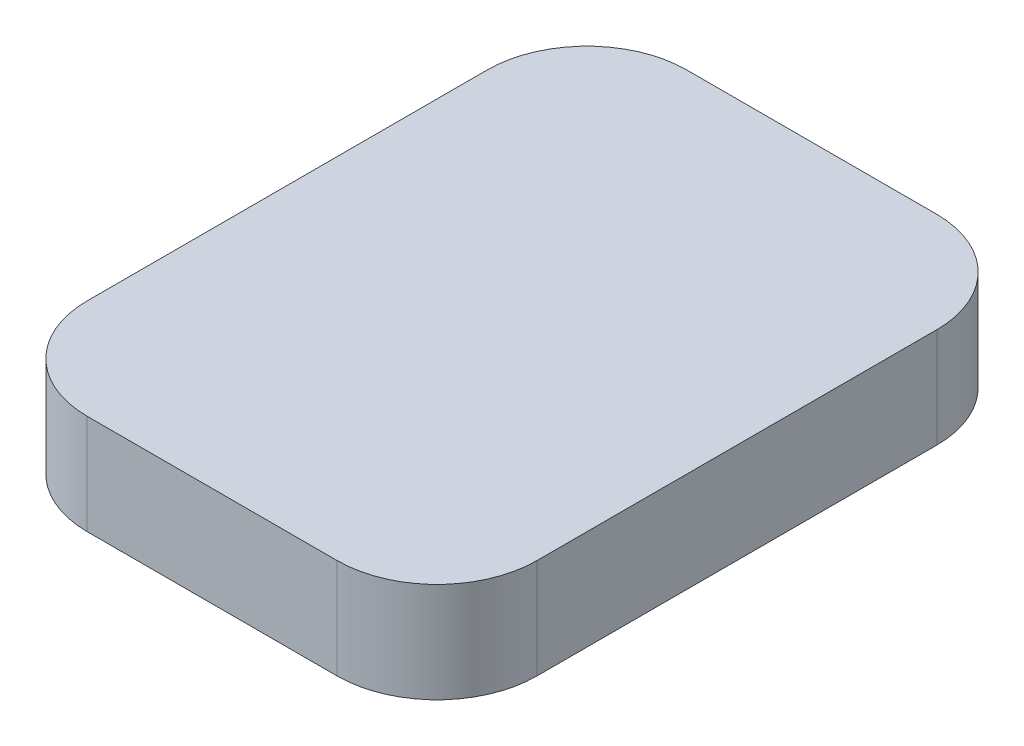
ISO-10303-21;
HEADER;
FILE_DESCRIPTION(('STEP AP214'),'2;1');
FILE_NAME('part.step','',(''),(''),'','','');
FILE_SCHEMA(('AUTOMOTIVE_DESIGN { 1 0 10303 214 1 1 1 1 }'));
ENDSEC;
DATA;
#1=APPLICATION_CONTEXT('core data for automotive mechanical design processes');
#2=APPLICATION_PROTOCOL_DEFINITION('international standard','automotive_design',2000,#1);
#3=PRODUCT_CONTEXT('',#1,'mechanical');
#4=PRODUCT('Part','Part','',(#3));
#5=PRODUCT_RELATED_PRODUCT_CATEGORY('part','',(#4));
#6=PRODUCT_DEFINITION_FORMATION('','',#4);
#7=PRODUCT_DEFINITION_CONTEXT('part definition',#1,'design');
#8=PRODUCT_DEFINITION('design','',#6,#7);
#9=PRODUCT_DEFINITION_SHAPE('','',#8);
#10=(LENGTH_UNIT() NAMED_UNIT(*) SI_UNIT(.MILLI.,.METRE.));
#11=(NAMED_UNIT(*) PLANE_ANGLE_UNIT() SI_UNIT($,.RADIAN.));
#12=(NAMED_UNIT(*) SI_UNIT($,.STERADIAN.) SOLID_ANGLE_UNIT());
#13=UNCERTAINTY_MEASURE_WITH_UNIT(LENGTH_MEASURE(1.E-05),#10,'distance_accuracy_value','');
#14=(GEOMETRIC_REPRESENTATION_CONTEXT(3) GLOBAL_UNCERTAINTY_ASSIGNED_CONTEXT((#13)) GLOBAL_UNIT_ASSIGNED_CONTEXT((#10,
#11,#12)) REPRESENTATION_CONTEXT('',''));
#15=CARTESIAN_POINT('',(0.,0.,0.));
#16=DIRECTION('',(0.,0.,1.));
#17=DIRECTION('',(1.,0.,0.));
#18=AXIS2_PLACEMENT_3D('',#15,#16,#17);
#19=CARTESIAN_POINT('',(-16.5171922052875,2.,-10.080148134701));
#20=DIRECTION('',(0.,-1.,0.));
#21=DIRECTION('',(0.,0.,-1.));
#22=AXIS2_PLACEMENT_3D('',#19,#20,#21);
#23=CYLINDRICAL_SURFACE('',#22,2.);
#24=CARTESIAN_POINT('',(-16.5171922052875,0.,-10.080148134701));
#25=DIRECTION('',(0.,1.,0.));
#26=DIRECTION('',(0.,0.,-1.));
#27=AXIS2_PLACEMENT_3D('',#24,#25,#26);
#28=CIRCLE('',#27,2.);
#29=CARTESIAN_POINT('',(-16.5171922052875,0.,-12.080148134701));
#30=VERTEX_POINT('',#29);
#31=CARTESIAN_POINT('',(-18.5171922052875,0.,-10.080148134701));
#32=VERTEX_POINT('',#31);
#33=EDGE_CURVE('E136',#30,#32,#28,.T.);
#34=ORIENTED_EDGE('',*,*,#33,.T.);
#35=DIRECTION('',(0.,-1.,0.));
#36=VECTOR('',#35,1.);
#37=CARTESIAN_POINT('',(-18.5171922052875,2.,-10.080148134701));
#38=LINE('',#37,#36);
#39=CARTESIAN_POINT('',(-18.5171922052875,2.,-10.080148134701));
#40=VERTEX_POINT('',#39);
#41=EDGE_CURVE('E11',#40,#32,#38,.T.);
#42=ORIENTED_EDGE('',*,*,#41,.F.);
#43=CARTESIAN_POINT('',(-16.5171922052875,2.,-10.080148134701));
#44=DIRECTION('',(0.,1.,0.));
#45=DIRECTION('',(0.,0.,-1.));
#46=AXIS2_PLACEMENT_3D('',#43,#44,#45);
#47=CIRCLE('',#46,2.);
#48=CARTESIAN_POINT('',(-16.5171922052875,2.,-12.080148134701));
#49=VERTEX_POINT('',#48);
#50=EDGE_CURVE('E150',#49,#40,#47,.T.);
#51=ORIENTED_EDGE('',*,*,#50,.F.);
#52=DIRECTION('',(0.,-1.,0.));
#53=VECTOR('',#52,1.);
#54=CARTESIAN_POINT('',(-16.5171922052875,2.,-12.080148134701));
#55=LINE('',#54,#53);
#56=EDGE_CURVE('E132',#49,#30,#55,.T.);
#57=ORIENTED_EDGE('',*,*,#56,.T.);
#58=EDGE_LOOP('',(#34,#42,#51,#57));
#59=FACE_BOUND('',#58,.T.);
#60=ADVANCED_FACE('F40',(#59),#23,.T.);
#61=CARTESIAN_POINT('',(-18.5171922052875,2.,-2.08014813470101));
#62=DIRECTION('',(1.,0.,0.));
#63=DIRECTION('',(0.,0.,-1.));
#64=AXIS2_PLACEMENT_3D('',#61,#62,#63);
#65=PLANE('',#64);
#66=DIRECTION('',(0.,0.,1.));
#67=VECTOR('',#66,1.);
#68=CARTESIAN_POINT('',(-18.5171922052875,0.,-2.08014813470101));
#69=LINE('',#68,#67);
#70=CARTESIAN_POINT('',(-18.5171922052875,0.,-2.08014813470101));
#71=VERTEX_POINT('',#70);
#72=EDGE_CURVE('E139',#32,#71,#69,.T.);
#73=ORIENTED_EDGE('',*,*,#72,.T.);
#74=DIRECTION('',(0.,-1.,0.));
#75=VECTOR('',#74,1.);
#76=CARTESIAN_POINT('',(-18.5171922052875,2.,-2.08014813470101));
#77=LINE('',#76,#75);
#78=CARTESIAN_POINT('',(-18.5171922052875,2.,-2.08014813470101));
#79=VERTEX_POINT('',#78);
#80=EDGE_CURVE('E48',#79,#71,#77,.T.);
#81=ORIENTED_EDGE('',*,*,#80,.F.);
#82=DIRECTION('',(0.,0.,1.));
#83=VECTOR('',#82,1.);
#84=CARTESIAN_POINT('',(-18.5171922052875,2.,-2.08014813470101));
#85=LINE('',#84,#83);
#86=EDGE_CURVE('E99',#40,#79,#85,.T.);
#87=ORIENTED_EDGE('',*,*,#86,.F.);
#88=ORIENTED_EDGE('',*,*,#41,.T.);
#89=EDGE_LOOP('',(#73,#81,#87,#88));
#90=FACE_BOUND('',#89,.T.);
#91=ADVANCED_FACE('F185',(#90),#65,.F.);
#92=CARTESIAN_POINT('',(-16.5171922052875,2.,-2.08014813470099));
#93=DIRECTION('',(0.,-1.,0.));
#94=DIRECTION('',(0.,0.,-1.));
#95=AXIS2_PLACEMENT_3D('',#92,#93,#94);
#96=CYLINDRICAL_SURFACE('',#95,2.);
#97=CARTESIAN_POINT('',(-16.5171922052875,0.,-2.08014813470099));
#98=DIRECTION('',(0.,1.,0.));
#99=DIRECTION('',(0.,0.,1.));
#100=AXIS2_PLACEMENT_3D('',#97,#98,#99);
#101=CIRCLE('',#100,2.);
#102=CARTESIAN_POINT('',(-16.5171922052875,0.,-0.0801481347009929));
#103=VERTEX_POINT('',#102);
#104=EDGE_CURVE('E141',#71,#103,#101,.T.);
#105=ORIENTED_EDGE('',*,*,#104,.T.);
#106=DIRECTION('',(0.,-1.,0.));
#107=VECTOR('',#106,1.);
#108=CARTESIAN_POINT('',(-16.5171922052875,2.,-0.0801481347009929));
#109=LINE('',#108,#107);
#110=CARTESIAN_POINT('',(-16.5171922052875,2.,-0.0801481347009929));
#111=VERTEX_POINT('',#110);
#112=EDGE_CURVE('E157',#111,#103,#109,.T.);
#113=ORIENTED_EDGE('',*,*,#112,.F.);
#114=CARTESIAN_POINT('',(-16.5171922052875,2.,-2.08014813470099));
#115=DIRECTION('',(0.,1.,0.));
#116=DIRECTION('',(0.,0.,1.));
#117=AXIS2_PLACEMENT_3D('',#114,#115,#116);
#118=CIRCLE('',#117,2.);
#119=EDGE_CURVE('E165',#79,#111,#118,.T.);
#120=ORIENTED_EDGE('',*,*,#119,.F.);
#121=ORIENTED_EDGE('',*,*,#80,.T.);
#122=EDGE_LOOP('',(#105,#113,#120,#121));
#123=FACE_BOUND('',#122,.T.);
#124=ADVANCED_FACE('F163',(#123),#96,.T.);
#125=CARTESIAN_POINT('',(-11.5171922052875,2.,-0.0801481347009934));
#126=DIRECTION('',(0.,0.,-1.));
#127=DIRECTION('',(-1.,0.,0.));
#128=AXIS2_PLACEMENT_3D('',#125,#126,#127);
#129=PLANE('',#128);
#130=DIRECTION('',(1.,0.,0.));
#131=VECTOR('',#130,1.);
#132=CARTESIAN_POINT('',(-11.5171922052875,0.,-0.0801481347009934));
#133=LINE('',#132,#131);
#134=CARTESIAN_POINT('',(-11.5171922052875,0.,-0.0801481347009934));
#135=VERTEX_POINT('',#134);
#136=EDGE_CURVE('E143',#103,#135,#133,.T.);
#137=ORIENTED_EDGE('',*,*,#136,.T.);
#138=DIRECTION('',(0.,-1.,0.));
#139=VECTOR('',#138,1.);
#140=CARTESIAN_POINT('',(-11.5171922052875,2.,-0.0801481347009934));
#141=LINE('',#140,#139);
#142=CARTESIAN_POINT('',(-11.5171922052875,2.,-0.0801481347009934));
#143=VERTEX_POINT('',#142);
#144=EDGE_CURVE('E154',#143,#135,#141,.T.);
#145=ORIENTED_EDGE('',*,*,#144,.F.);
#146=DIRECTION('',(1.,0.,0.));
#147=VECTOR('',#146,1.);
#148=CARTESIAN_POINT('',(-11.5171922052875,2.,-0.0801481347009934));
#149=LINE('',#148,#147);
#150=EDGE_CURVE('E177',#111,#143,#149,.T.);
#151=ORIENTED_EDGE('',*,*,#150,.F.);
#152=ORIENTED_EDGE('',*,*,#112,.T.);
#153=EDGE_LOOP('',(#137,#145,#151,#152));
#154=FACE_BOUND('',#153,.T.);
#155=ADVANCED_FACE('F173',(#154),#129,.F.);
#156=CARTESIAN_POINT('',(-11.5171922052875,2.,-2.08014813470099));
#157=DIRECTION('',(0.,-1.,0.));
#158=DIRECTION('',(0.,0.,-1.));
#159=AXIS2_PLACEMENT_3D('',#156,#157,#158);
#160=CYLINDRICAL_SURFACE('',#159,2.);
#161=CARTESIAN_POINT('',(-11.5171922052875,0.,-2.08014813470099));
#162=DIRECTION('',(0.,1.,0.));
#163=DIRECTION('',(0.,0.,1.));
#164=AXIS2_PLACEMENT_3D('',#161,#162,#163);
#165=CIRCLE('',#164,2.);
#166=CARTESIAN_POINT('',(-9.51719220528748,0.,-2.08014813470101));
#167=VERTEX_POINT('',#166);
#168=EDGE_CURVE('E145',#135,#167,#165,.T.);
#169=ORIENTED_EDGE('',*,*,#168,.T.);
#170=DIRECTION('',(0.,-1.,0.));
#171=VECTOR('',#170,1.);
#172=CARTESIAN_POINT('',(-9.51719220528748,2.,-2.08014813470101));
#173=LINE('',#172,#171);
#174=CARTESIAN_POINT('',(-9.51719220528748,2.,-2.08014813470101));
#175=VERTEX_POINT('',#174);
#176=EDGE_CURVE('E127',#175,#167,#173,.T.);
#177=ORIENTED_EDGE('',*,*,#176,.F.);
#178=CARTESIAN_POINT('',(-11.5171922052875,2.,-2.08014813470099));
#179=DIRECTION('',(0.,1.,0.));
#180=DIRECTION('',(0.,0.,1.));
#181=AXIS2_PLACEMENT_3D('',#178,#179,#180);
#182=CIRCLE('',#181,2.);
#183=EDGE_CURVE('E118',#143,#175,#182,.T.);
#184=ORIENTED_EDGE('',*,*,#183,.F.);
#185=ORIENTED_EDGE('',*,*,#144,.T.);
#186=EDGE_LOOP('',(#169,#177,#184,#185));
#187=FACE_BOUND('',#186,.T.);
#188=ADVANCED_FACE('F176',(#187),#160,.T.);
#189=CARTESIAN_POINT('',(-9.51719220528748,2.,-2.08014813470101));
#190=DIRECTION('',(-1.,0.,0.));
#191=DIRECTION('',(0.,0.,1.));
#192=AXIS2_PLACEMENT_3D('',#189,#190,#191);
#193=PLANE('',#192);
#194=DIRECTION('',(0.,0.,-1.));
#195=VECTOR('',#194,1.);
#196=CARTESIAN_POINT('',(-9.51719220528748,0.,-2.08014813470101));
#197=LINE('',#196,#195);
#198=CARTESIAN_POINT('',(-9.51719220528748,0.,-10.080148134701));
#199=VERTEX_POINT('',#198);
#200=EDGE_CURVE('E126',#167,#199,#197,.T.);
#201=ORIENTED_EDGE('',*,*,#200,.T.);
#202=DIRECTION('',(0.,-1.,0.));
#203=VECTOR('',#202,1.);
#204=CARTESIAN_POINT('',(-9.51719220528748,2.,-10.080148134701));
#205=LINE('',#204,#203);
#206=CARTESIAN_POINT('',(-9.51719220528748,2.,-10.080148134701));
#207=VERTEX_POINT('',#206);
#208=EDGE_CURVE('E123',#207,#199,#205,.T.);
#209=ORIENTED_EDGE('',*,*,#208,.F.);
#210=DIRECTION('',(0.,0.,-1.));
#211=VECTOR('',#210,1.);
#212=CARTESIAN_POINT('',(-9.51719220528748,2.,-2.08014813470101));
#213=LINE('',#212,#211);
#214=EDGE_CURVE('E112',#175,#207,#213,.T.);
#215=ORIENTED_EDGE('',*,*,#214,.F.);
#216=ORIENTED_EDGE('',*,*,#176,.T.);
#217=EDGE_LOOP('',(#201,#209,#215,#216));
#218=FACE_BOUND('',#217,.T.);
#219=ADVANCED_FACE('F124',(#218),#193,.F.);
#220=CARTESIAN_POINT('',(-11.5171922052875,2.,-10.080148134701));
#221=DIRECTION('',(0.,-1.,0.));
#222=DIRECTION('',(0.,0.,-1.));
#223=AXIS2_PLACEMENT_3D('',#220,#221,#222);
#224=CYLINDRICAL_SURFACE('',#223,2.);
#225=CARTESIAN_POINT('',(-11.5171922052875,0.,-10.080148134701));
#226=DIRECTION('',(0.,1.,0.));
#227=DIRECTION('',(0.,0.,-1.));
#228=AXIS2_PLACEMENT_3D('',#225,#226,#227);
#229=CIRCLE('',#228,2.);
#230=CARTESIAN_POINT('',(-11.5171922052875,0.,-12.080148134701));
#231=VERTEX_POINT('',#230);
#232=EDGE_CURVE('E85',#199,#231,#229,.T.);
#233=ORIENTED_EDGE('',*,*,#232,.T.);
#234=DIRECTION('',(0.,-1.,0.));
#235=VECTOR('',#234,1.);
#236=CARTESIAN_POINT('',(-11.5171922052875,2.,-12.080148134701));
#237=LINE('',#236,#235);
#238=CARTESIAN_POINT('',(-11.5171922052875,2.,-12.080148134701));
#239=VERTEX_POINT('',#238);
#240=EDGE_CURVE('E128',#239,#231,#237,.T.);
#241=ORIENTED_EDGE('',*,*,#240,.F.);
#242=CARTESIAN_POINT('',(-11.5171922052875,2.,-10.080148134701));
#243=DIRECTION('',(0.,1.,0.));
#244=DIRECTION('',(0.,0.,-1.));
#245=AXIS2_PLACEMENT_3D('',#242,#243,#244);
#246=CIRCLE('',#245,2.);
#247=EDGE_CURVE('E116',#207,#239,#246,.T.);
#248=ORIENTED_EDGE('',*,*,#247,.F.);
#249=ORIENTED_EDGE('',*,*,#208,.T.);
#250=EDGE_LOOP('',(#233,#241,#248,#249));
#251=FACE_BOUND('',#250,.T.);
#252=ADVANCED_FACE('F130',(#251),#224,.T.);
#253=CARTESIAN_POINT('',(-11.5171922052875,2.,-12.080148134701));
#254=DIRECTION('',(0.,0.,1.));
#255=DIRECTION('',(1.,0.,0.));
#256=AXIS2_PLACEMENT_3D('',#253,#254,#255);
#257=PLANE('',#256);
#258=DIRECTION('',(-1.,0.,0.));
#259=VECTOR('',#258,1.);
#260=CARTESIAN_POINT('',(-11.5171922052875,0.,-12.080148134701));
#261=LINE('',#260,#259);
#262=EDGE_CURVE('E91',#231,#30,#261,.T.);
#263=ORIENTED_EDGE('',*,*,#262,.T.);
#264=ORIENTED_EDGE('',*,*,#56,.F.);
#265=DIRECTION('',(-1.,0.,0.));
#266=VECTOR('',#265,1.);
#267=CARTESIAN_POINT('',(-11.5171922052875,2.,-12.080148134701));
#268=LINE('',#267,#266);
#269=EDGE_CURVE('E56',#239,#49,#268,.T.);
#270=ORIENTED_EDGE('',*,*,#269,.F.);
#271=ORIENTED_EDGE('',*,*,#240,.T.);
#272=EDGE_LOOP('',(#263,#264,#270,#271));
#273=FACE_BOUND('',#272,.T.);
#274=ADVANCED_FACE('F201',(#273),#257,.F.);
#275=CARTESIAN_POINT('',(-16.5171922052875,2.,-10.080148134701));
#276=DIRECTION('',(0.,-1.,0.));
#277=DIRECTION('',(0.,0.,-1.));
#278=AXIS2_PLACEMENT_3D('',#275,#276,#277);
#279=PLANE('',#278);
#280=ORIENTED_EDGE('',*,*,#50,.T.);
#281=ORIENTED_EDGE('',*,*,#86,.T.);
#282=ORIENTED_EDGE('',*,*,#119,.T.);
#283=ORIENTED_EDGE('',*,*,#150,.T.);
#284=ORIENTED_EDGE('',*,*,#183,.T.);
#285=ORIENTED_EDGE('',*,*,#214,.T.);
#286=ORIENTED_EDGE('',*,*,#247,.T.);
#287=ORIENTED_EDGE('',*,*,#269,.T.);
#288=EDGE_LOOP('',(#280,#281,#282,#283,#284,#285,#286,#287));
#289=FACE_BOUND('',#288,.T.);
#290=ADVANCED_FACE('F114',(#289),#279,.F.);
#291=CARTESIAN_POINT('',(-16.5171922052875,0.,-10.080148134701));
#292=DIRECTION('',(0.,-1.,0.));
#293=DIRECTION('',(0.,0.,-1.));
#294=AXIS2_PLACEMENT_3D('',#291,#292,#293);
#295=PLANE('',#294);
#296=ORIENTED_EDGE('',*,*,#33,.F.);
#297=ORIENTED_EDGE('',*,*,#262,.F.);
#298=ORIENTED_EDGE('',*,*,#232,.F.);
#299=ORIENTED_EDGE('',*,*,#200,.F.);
#300=ORIENTED_EDGE('',*,*,#168,.F.);
#301=ORIENTED_EDGE('',*,*,#136,.F.);
#302=ORIENTED_EDGE('',*,*,#104,.F.);
#303=ORIENTED_EDGE('',*,*,#72,.F.);
#304=EDGE_LOOP('',(#296,#297,#298,#299,#300,#301,#302,#303));
#305=FACE_BOUND('',#304,.T.);
#306=ADVANCED_FACE('F169',(#305),#295,.T.);
#307=CLOSED_SHELL('',(#60,#91,#124,#155,#188,#219,#252,#274,#290,#306));
#308=MANIFOLD_SOLID_BREP('B2',#307);
#309=ADVANCED_BREP_SHAPE_REPRESENTATION('',(#18,#308),#14);
#310=SHAPE_DEFINITION_REPRESENTATION(#9,#309);
ENDSEC;
END-ISO-10303-21;
